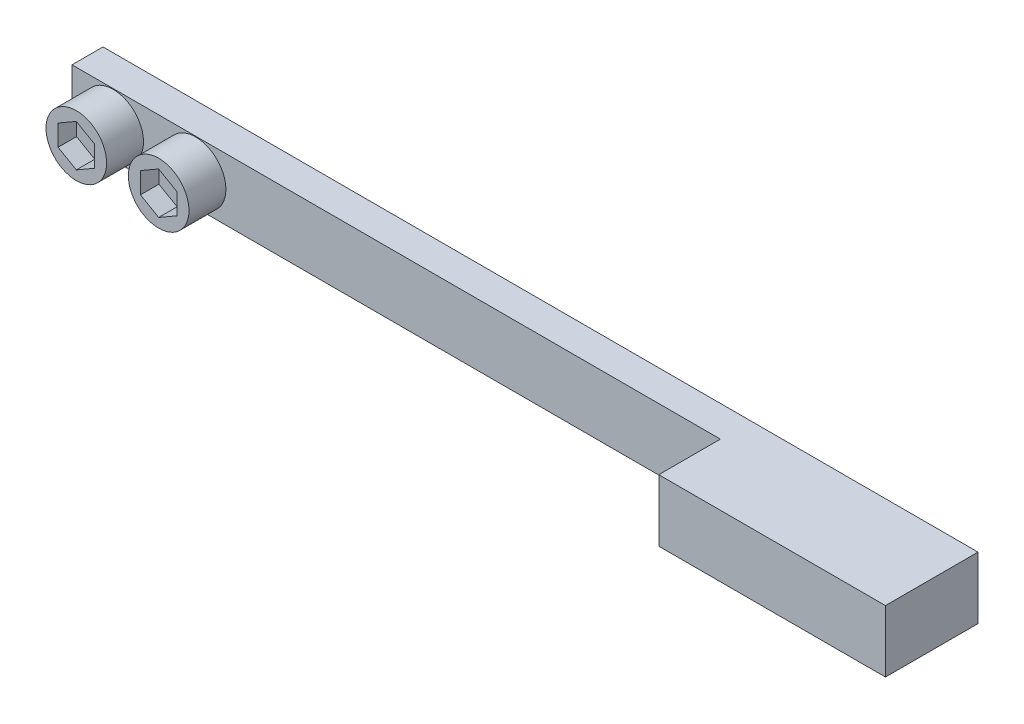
ISO-10303-21;
HEADER;
FILE_DESCRIPTION(('STEP AP214'),'2;1');
FILE_NAME('part.step','',(''),(''),'','','');
FILE_SCHEMA(('AUTOMOTIVE_DESIGN { 1 0 10303 214 1 1 1 1 }'));
ENDSEC;
DATA;
#1=APPLICATION_CONTEXT('core data for automotive mechanical design processes');
#2=APPLICATION_PROTOCOL_DEFINITION('international standard','automotive_design',2000,#1);
#3=PRODUCT_CONTEXT('',#1,'mechanical');
#4=PRODUCT('Part','Part','',(#3));
#5=PRODUCT_RELATED_PRODUCT_CATEGORY('part','',(#4));
#6=PRODUCT_DEFINITION_FORMATION('','',#4);
#7=PRODUCT_DEFINITION_CONTEXT('part definition',#1,'design');
#8=PRODUCT_DEFINITION('design','',#6,#7);
#9=PRODUCT_DEFINITION_SHAPE('','',#8);
#10=(LENGTH_UNIT() NAMED_UNIT(*) SI_UNIT(.MILLI.,.METRE.));
#11=(NAMED_UNIT(*) PLANE_ANGLE_UNIT() SI_UNIT($,.RADIAN.));
#12=(NAMED_UNIT(*) SI_UNIT($,.STERADIAN.) SOLID_ANGLE_UNIT());
#13=UNCERTAINTY_MEASURE_WITH_UNIT(LENGTH_MEASURE(1.E-05),#10,'distance_accuracy_value','');
#14=(GEOMETRIC_REPRESENTATION_CONTEXT(3) GLOBAL_UNCERTAINTY_ASSIGNED_CONTEXT((#13)) GLOBAL_UNIT_ASSIGNED_CONTEXT((#10,
#11,#12)) REPRESENTATION_CONTEXT('',''));
#15=CARTESIAN_POINT('',(0.,0.,0.));
#16=DIRECTION('',(0.,0.,1.));
#17=DIRECTION('',(1.,0.,0.));
#18=AXIS2_PLACEMENT_3D('',#15,#16,#17);
#19=CARTESIAN_POINT('',(-33.7312,2.3876,1.1938));
#20=DIRECTION('',(0.,0.,-1.));
#21=DIRECTION('',(-1.,0.,0.));
#22=AXIS2_PLACEMENT_3D('',#19,#20,#21);
#23=PLANE('',#22);
#24=CARTESIAN_POINT('',(-30.5562,0.,1.1938));
#25=DIRECTION('',(0.,0.,-1.));
#26=DIRECTION('',(-1.,0.,0.));
#27=AXIS2_PLACEMENT_3D('',#24,#25,#26);
#28=CIRCLE('',#27,2.3368);
#29=CARTESIAN_POINT('',(-32.893,0.,1.1938));
#30=VERTEX_POINT('',#29);
#31=EDGE_CURVE('E41',#30,#30,#28,.F.);
#32=ORIENTED_EDGE('',*,*,#31,.F.);
#33=EDGE_LOOP('',(#32));
#34=FACE_BOUND('',#33,.T.);
#35=DIRECTION('',(1.,0.,0.));
#36=VECTOR('',#35,1.);
#37=CARTESIAN_POINT('',(-33.7312,-2.3876,1.1938));
#38=LINE('',#37,#36);
#39=CARTESIAN_POINT('',(-33.7312,-2.3876,1.1938));
#40=VERTEX_POINT('',#39);
#41=CARTESIAN_POINT('',(16.256,-2.3876,1.1938));
#42=VERTEX_POINT('',#41);
#43=EDGE_CURVE('E284',#40,#42,#38,.T.);
#44=ORIENTED_EDGE('',*,*,#43,.T.);
#45=DIRECTION('',(0.,-1.,0.));
#46=VECTOR('',#45,1.);
#47=CARTESIAN_POINT('',(16.256,2.3876,1.1938));
#48=LINE('',#47,#46);
#49=CARTESIAN_POINT('',(16.256,2.3876,1.1938));
#50=VERTEX_POINT('',#49);
#51=EDGE_CURVE('E299',#50,#42,#48,.T.);
#52=ORIENTED_EDGE('',*,*,#51,.F.);
#53=DIRECTION('',(1.,0.,0.));
#54=VECTOR('',#53,1.);
#55=CARTESIAN_POINT('',(-33.7312,2.3876,1.1938));
#56=LINE('',#55,#54);
#57=CARTESIAN_POINT('',(-33.7312,2.3876,1.1938));
#58=VERTEX_POINT('',#57);
#59=EDGE_CURVE('E271',#58,#50,#56,.T.);
#60=ORIENTED_EDGE('',*,*,#59,.F.);
#61=DIRECTION('',(0.,-1.,0.));
#62=VECTOR('',#61,1.);
#63=CARTESIAN_POINT('',(-33.7312,2.3876,1.1938));
#64=LINE('',#63,#62);
#65=EDGE_CURVE('E302',#58,#40,#64,.T.);
#66=ORIENTED_EDGE('',*,*,#65,.T.);
#67=EDGE_LOOP('',(#44,#52,#60,#66));
#68=FACE_BOUND('',#67,.T.);
#69=CARTESIAN_POINT('',(-24.2062,0.,1.1938));
#70=DIRECTION('',(0.,0.,-1.));
#71=DIRECTION('',(-1.,0.,0.));
#72=AXIS2_PLACEMENT_3D('',#69,#70,#71);
#73=CIRCLE('',#72,2.3368);
#74=CARTESIAN_POINT('',(-26.543,0.,1.1938));
#75=VERTEX_POINT('',#74);
#76=EDGE_CURVE('E11',#75,#75,#73,.F.);
#77=ORIENTED_EDGE('',*,*,#76,.F.);
#78=EDGE_LOOP('',(#77));
#79=FACE_BOUND('',#78,.T.);
#80=ADVANCED_FACE('F33',(#34,#68,#79),#23,.F.);
#81=CARTESIAN_POINT('',(33.7312,2.3876,-1.1938));
#82=DIRECTION('',(0.,0.,1.));
#83=DIRECTION('',(1.,0.,0.));
#84=AXIS2_PLACEMENT_3D('',#81,#82,#83);
#85=PLANE('',#84);
#86=DIRECTION('',(-1.,0.,0.));
#87=VECTOR('',#86,1.);
#88=CARTESIAN_POINT('',(33.7312,-2.3876,-1.1938));
#89=LINE('',#88,#87);
#90=CARTESIAN_POINT('',(33.7312,-2.3876,-1.1938));
#91=VERTEX_POINT('',#90);
#92=CARTESIAN_POINT('',(-33.7312,-2.3876,-1.1938));
#93=VERTEX_POINT('',#92);
#94=EDGE_CURVE('E264',#91,#93,#89,.T.);
#95=ORIENTED_EDGE('',*,*,#94,.T.);
#96=DIRECTION('',(0.,-1.,0.));
#97=VECTOR('',#96,1.);
#98=CARTESIAN_POINT('',(-33.7312,2.3876,-1.1938));
#99=LINE('',#98,#97);
#100=CARTESIAN_POINT('',(-33.7312,2.3876,-1.1938));
#101=VERTEX_POINT('',#100);
#102=EDGE_CURVE('E305',#101,#93,#99,.T.);
#103=ORIENTED_EDGE('',*,*,#102,.F.);
#104=DIRECTION('',(-1.,0.,0.));
#105=VECTOR('',#104,1.);
#106=CARTESIAN_POINT('',(33.7312,2.3876,-1.1938));
#107=LINE('',#106,#105);
#108=CARTESIAN_POINT('',(33.7312,2.3876,-1.1938));
#109=VERTEX_POINT('',#108);
#110=EDGE_CURVE('E265',#109,#101,#107,.T.);
#111=ORIENTED_EDGE('',*,*,#110,.F.);
#112=DIRECTION('',(0.,-1.,0.));
#113=VECTOR('',#112,1.);
#114=CARTESIAN_POINT('',(33.7312,2.3876,-1.1938));
#115=LINE('',#114,#113);
#116=EDGE_CURVE('E279',#109,#91,#115,.T.);
#117=ORIENTED_EDGE('',*,*,#116,.T.);
#118=EDGE_LOOP('',(#95,#103,#111,#117));
#119=FACE_BOUND('',#118,.T.);
#120=ADVANCED_FACE('F35',(#119),#85,.F.);
#121=CARTESIAN_POINT('',(-33.7312,2.3876,-1.1938));
#122=DIRECTION('',(1.,0.,0.));
#123=DIRECTION('',(0.,0.,-1.));
#124=AXIS2_PLACEMENT_3D('',#121,#122,#123);
#125=PLANE('',#124);
#126=DIRECTION('',(0.,0.,1.));
#127=VECTOR('',#126,1.);
#128=CARTESIAN_POINT('',(-33.7312,-2.3876,-1.1938));
#129=LINE('',#128,#127);
#130=EDGE_CURVE('E282',#93,#40,#129,.T.);
#131=ORIENTED_EDGE('',*,*,#130,.T.);
#132=ORIENTED_EDGE('',*,*,#65,.F.);
#133=DIRECTION('',(0.,0.,1.));
#134=VECTOR('',#133,1.);
#135=CARTESIAN_POINT('',(-33.7312,2.3876,-1.1938));
#136=LINE('',#135,#134);
#137=EDGE_CURVE('E268',#101,#58,#136,.T.);
#138=ORIENTED_EDGE('',*,*,#137,.F.);
#139=ORIENTED_EDGE('',*,*,#102,.T.);
#140=EDGE_LOOP('',(#131,#132,#138,#139));
#141=FACE_BOUND('',#140,.T.);
#142=ADVANCED_FACE('F385',(#141),#125,.F.);
#143=CARTESIAN_POINT('',(16.256,2.3876,1.1938));
#144=DIRECTION('',(1.,0.,0.));
#145=DIRECTION('',(0.,0.,-1.));
#146=AXIS2_PLACEMENT_3D('',#143,#144,#145);
#147=PLANE('',#146);
#148=DIRECTION('',(0.,0.,1.));
#149=VECTOR('',#148,1.);
#150=CARTESIAN_POINT('',(16.256,-2.3876,1.1938));
#151=LINE('',#150,#149);
#152=CARTESIAN_POINT('',(16.256,-2.3876,5.9436));
#153=VERTEX_POINT('',#152);
#154=EDGE_CURVE('E286',#42,#153,#151,.T.);
#155=ORIENTED_EDGE('',*,*,#154,.T.);
#156=DIRECTION('',(0.,-1.,0.));
#157=VECTOR('',#156,1.);
#158=CARTESIAN_POINT('',(16.256,2.3876,5.9436));
#159=LINE('',#158,#157);
#160=CARTESIAN_POINT('',(16.256,2.3876,5.9436));
#161=VERTEX_POINT('',#160);
#162=EDGE_CURVE('E296',#161,#153,#159,.T.);
#163=ORIENTED_EDGE('',*,*,#162,.F.);
#164=DIRECTION('',(0.,0.,1.));
#165=VECTOR('',#164,1.);
#166=CARTESIAN_POINT('',(16.256,2.3876,1.1938));
#167=LINE('',#166,#165);
#168=EDGE_CURVE('E273',#50,#161,#167,.T.);
#169=ORIENTED_EDGE('',*,*,#168,.F.);
#170=ORIENTED_EDGE('',*,*,#51,.T.);
#171=EDGE_LOOP('',(#155,#163,#169,#170));
#172=FACE_BOUND('',#171,.T.);
#173=ADVANCED_FACE('F382',(#172),#147,.F.);
#174=CARTESIAN_POINT('',(16.256,2.3876,5.9436));
#175=DIRECTION('',(0.,0.,-1.));
#176=DIRECTION('',(-1.,0.,0.));
#177=AXIS2_PLACEMENT_3D('',#174,#175,#176);
#178=PLANE('',#177);
#179=DIRECTION('',(1.,0.,0.));
#180=VECTOR('',#179,1.);
#181=CARTESIAN_POINT('',(16.256,-2.3876,5.9436));
#182=LINE('',#181,#180);
#183=CARTESIAN_POINT('',(33.7312,-2.3876,5.9436));
#184=VERTEX_POINT('',#183);
#185=EDGE_CURVE('E288',#153,#184,#182,.T.);
#186=ORIENTED_EDGE('',*,*,#185,.T.);
#187=DIRECTION('',(0.,-1.,0.));
#188=VECTOR('',#187,1.);
#189=CARTESIAN_POINT('',(33.7312,2.3876,5.9436));
#190=LINE('',#189,#188);
#191=CARTESIAN_POINT('',(33.7312,2.3876,5.9436));
#192=VERTEX_POINT('',#191);
#193=EDGE_CURVE('E293',#192,#184,#190,.T.);
#194=ORIENTED_EDGE('',*,*,#193,.F.);
#195=DIRECTION('',(1.,0.,0.));
#196=VECTOR('',#195,1.);
#197=CARTESIAN_POINT('',(16.256,2.3876,5.9436));
#198=LINE('',#197,#196);
#199=EDGE_CURVE('E275',#161,#192,#198,.T.);
#200=ORIENTED_EDGE('',*,*,#199,.F.);
#201=ORIENTED_EDGE('',*,*,#162,.T.);
#202=EDGE_LOOP('',(#186,#194,#200,#201));
#203=FACE_BOUND('',#202,.T.);
#204=ADVANCED_FACE('F378',(#203),#178,.F.);
#205=CARTESIAN_POINT('',(33.7312,2.3876,5.9436));
#206=DIRECTION('',(-1.,0.,0.));
#207=DIRECTION('',(0.,0.,1.));
#208=AXIS2_PLACEMENT_3D('',#205,#206,#207);
#209=PLANE('',#208);
#210=DIRECTION('',(0.,0.,-1.));
#211=VECTOR('',#210,1.);
#212=CARTESIAN_POINT('',(33.7312,-2.3876,5.9436));
#213=LINE('',#212,#211);
#214=EDGE_CURVE('E269',#184,#91,#213,.T.);
#215=ORIENTED_EDGE('',*,*,#214,.T.);
#216=ORIENTED_EDGE('',*,*,#116,.F.);
#217=DIRECTION('',(0.,0.,-1.));
#218=VECTOR('',#217,1.);
#219=CARTESIAN_POINT('',(33.7312,2.3876,5.9436));
#220=LINE('',#219,#218);
#221=EDGE_CURVE('E277',#192,#109,#220,.T.);
#222=ORIENTED_EDGE('',*,*,#221,.F.);
#223=ORIENTED_EDGE('',*,*,#193,.T.);
#224=EDGE_LOOP('',(#215,#216,#222,#223));
#225=FACE_BOUND('',#224,.T.);
#226=ADVANCED_FACE('F371',(#225),#209,.F.);
#227=CARTESIAN_POINT('',(-33.7312,2.3876,-1.1938));
#228=DIRECTION('',(0.,1.,0.));
#229=DIRECTION('',(0.,0.,1.));
#230=AXIS2_PLACEMENT_3D('',#227,#228,#229);
#231=PLANE('',#230);
#232=ORIENTED_EDGE('',*,*,#110,.T.);
#233=ORIENTED_EDGE('',*,*,#137,.T.);
#234=ORIENTED_EDGE('',*,*,#59,.T.);
#235=ORIENTED_EDGE('',*,*,#168,.T.);
#236=ORIENTED_EDGE('',*,*,#199,.T.);
#237=ORIENTED_EDGE('',*,*,#221,.T.);
#238=EDGE_LOOP('',(#232,#233,#234,#235,#236,#237));
#239=FACE_BOUND('',#238,.T.);
#240=ADVANCED_FACE('F368',(#239),#231,.T.);
#241=CARTESIAN_POINT('',(-33.7312,-2.3876,-1.1938));
#242=DIRECTION('',(0.,1.,0.));
#243=DIRECTION('',(0.,0.,1.));
#244=AXIS2_PLACEMENT_3D('',#241,#242,#243);
#245=PLANE('',#244);
#246=ORIENTED_EDGE('',*,*,#94,.F.);
#247=ORIENTED_EDGE('',*,*,#214,.F.);
#248=ORIENTED_EDGE('',*,*,#185,.F.);
#249=ORIENTED_EDGE('',*,*,#154,.F.);
#250=ORIENTED_EDGE('',*,*,#43,.F.);
#251=ORIENTED_EDGE('',*,*,#130,.F.);
#252=EDGE_LOOP('',(#246,#247,#248,#249,#250,#251));
#253=FACE_BOUND('',#252,.T.);
#254=ADVANCED_FACE('F366',(#253),#245,.F.);
#255=CARTESIAN_POINT('',(-30.5562,0.,4.0386));
#256=DIRECTION('',(0.,0.,-1.));
#257=DIRECTION('',(-1.,0.,0.));
#258=AXIS2_PLACEMENT_3D('',#255,#256,#257);
#259=CYLINDRICAL_SURFACE('',#258,2.3368);
#260=CARTESIAN_POINT('',(-30.5562,0.,4.0386));
#261=DIRECTION('',(0.,0.,1.));
#262=DIRECTION('',(1.,0.,0.));
#263=AXIS2_PLACEMENT_3D('',#260,#261,#262);
#264=CIRCLE('',#263,2.3368);
#265=CARTESIAN_POINT('',(-28.2194,0.,4.0386));
#266=VERTEX_POINT('',#265);
#267=EDGE_CURVE('E252',#266,#266,#264,.T.);
#268=ORIENTED_EDGE('',*,*,#267,.F.);
#269=EDGE_LOOP('',(#268));
#270=FACE_BOUND('',#269,.T.);
#271=ORIENTED_EDGE('',*,*,#31,.T.);
#272=EDGE_LOOP('',(#271));
#273=FACE_BOUND('',#272,.T.);
#274=ADVANCED_FACE('F310',(#270,#273),#259,.T.);
#275=CARTESIAN_POINT('',(-30.5562,0.,4.0386));
#276=DIRECTION('',(0.,0.,1.));
#277=DIRECTION('',(1.,0.,0.));
#278=AXIS2_PLACEMENT_3D('',#275,#276,#277);
#279=PLANE('',#278);
#280=DIRECTION('',(-0.866025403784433,-0.500000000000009,0.));
#281=VECTOR('',#280,1.);
#282=CARTESIAN_POINT('',(-30.5562,1.6189825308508,4.0386));
#283=LINE('',#282,#281);
#284=CARTESIAN_POINT('',(-30.5562,1.6189825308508,4.0386));
#285=VERTEX_POINT('',#284);
#286=CARTESIAN_POINT('',(-31.95828,0.80949126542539,4.0386));
#287=VERTEX_POINT('',#286);
#288=EDGE_CURVE('E56',#285,#287,#283,.T.);
#289=ORIENTED_EDGE('',*,*,#288,.F.);
#290=DIRECTION('',(-0.866025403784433,0.500000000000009,0.));
#291=VECTOR('',#290,1.);
#292=CARTESIAN_POINT('',(-29.15412,0.80949126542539,4.0386));
#293=LINE('',#292,#291);
#294=CARTESIAN_POINT('',(-29.15412,0.80949126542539,4.0386));
#295=VERTEX_POINT('',#294);
#296=EDGE_CURVE('E219',#295,#285,#293,.T.);
#297=ORIENTED_EDGE('',*,*,#296,.F.);
#298=DIRECTION('',(0.,1.,0.));
#299=VECTOR('',#298,1.);
#300=CARTESIAN_POINT('',(-29.15412,-0.80949126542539,4.0386));
#301=LINE('',#300,#299);
#302=CARTESIAN_POINT('',(-29.15412,-0.80949126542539,4.0386));
#303=VERTEX_POINT('',#302);
#304=EDGE_CURVE('E245',#303,#295,#301,.T.);
#305=ORIENTED_EDGE('',*,*,#304,.F.);
#306=DIRECTION('',(0.866025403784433,0.500000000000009,0.));
#307=VECTOR('',#306,1.);
#308=CARTESIAN_POINT('',(-30.5562,-1.6189825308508,4.0386));
#309=LINE('',#308,#307);
#310=CARTESIAN_POINT('',(-30.5562,-1.6189825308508,4.0386));
#311=VERTEX_POINT('',#310);
#312=EDGE_CURVE('E242',#311,#303,#309,.T.);
#313=ORIENTED_EDGE('',*,*,#312,.F.);
#314=DIRECTION('',(0.866025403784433,-0.500000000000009,0.));
#315=VECTOR('',#314,1.);
#316=CARTESIAN_POINT('',(-31.95828,-0.80949126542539,4.0386));
#317=LINE('',#316,#315);
#318=CARTESIAN_POINT('',(-31.95828,-0.80949126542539,4.0386));
#319=VERTEX_POINT('',#318);
#320=EDGE_CURVE('E239',#319,#311,#317,.T.);
#321=ORIENTED_EDGE('',*,*,#320,.F.);
#322=DIRECTION('',(0.,-1.,0.));
#323=VECTOR('',#322,1.);
#324=CARTESIAN_POINT('',(-31.95828,0.80949126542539,4.0386));
#325=LINE('',#324,#323);
#326=EDGE_CURVE('E236',#287,#319,#325,.T.);
#327=ORIENTED_EDGE('',*,*,#326,.F.);
#328=EDGE_LOOP('',(#289,#297,#305,#313,#321,#327));
#329=FACE_BOUND('',#328,.T.);
#330=ORIENTED_EDGE('',*,*,#267,.T.);
#331=EDGE_LOOP('',(#330));
#332=FACE_BOUND('',#331,.T.);
#333=ADVANCED_FACE('F360',(#329,#332),#279,.T.);
#334=CARTESIAN_POINT('',(-30.5562,1.6189825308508,2.6162));
#335=DIRECTION('',(-0.500000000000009,0.866025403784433,0.));
#336=DIRECTION('',(-0.866025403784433,-0.500000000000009,0.));
#337=AXIS2_PLACEMENT_3D('',#334,#335,#336);
#338=PLANE('',#337);
#339=ORIENTED_EDGE('',*,*,#288,.T.);
#340=DIRECTION('',(0.,0.,1.));
#341=VECTOR('',#340,1.);
#342=CARTESIAN_POINT('',(-31.95828,0.80949126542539,2.6162));
#343=LINE('',#342,#341);
#344=CARTESIAN_POINT('',(-31.95828,0.80949126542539,2.6162));
#345=VERTEX_POINT('',#344);
#346=EDGE_CURVE('E234',#345,#287,#343,.T.);
#347=ORIENTED_EDGE('',*,*,#346,.F.);
#348=DIRECTION('',(-0.866025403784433,-0.500000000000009,0.));
#349=VECTOR('',#348,1.);
#350=CARTESIAN_POINT('',(-30.5562,1.6189825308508,2.6162));
#351=LINE('',#350,#349);
#352=CARTESIAN_POINT('',(-30.5562,1.6189825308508,2.6162));
#353=VERTEX_POINT('',#352);
#354=EDGE_CURVE('E215',#353,#345,#351,.T.);
#355=ORIENTED_EDGE('',*,*,#354,.F.);
#356=DIRECTION('',(0.,0.,1.));
#357=VECTOR('',#356,1.);
#358=CARTESIAN_POINT('',(-30.5562,1.6189825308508,2.6162));
#359=LINE('',#358,#357);
#360=EDGE_CURVE('E250',#353,#285,#359,.T.);
#361=ORIENTED_EDGE('',*,*,#360,.T.);
#362=EDGE_LOOP('',(#339,#347,#355,#361));
#363=FACE_BOUND('',#362,.T.);
#364=ADVANCED_FACE('F342',(#363),#338,.F.);
#365=CARTESIAN_POINT('',(-29.15412,0.80949126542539,2.6162));
#366=DIRECTION('',(0.500000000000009,0.866025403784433,0.));
#367=DIRECTION('',(-0.866025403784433,0.500000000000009,0.));
#368=AXIS2_PLACEMENT_3D('',#365,#366,#367);
#369=PLANE('',#368);
#370=ORIENTED_EDGE('',*,*,#296,.T.);
#371=ORIENTED_EDGE('',*,*,#360,.F.);
#372=DIRECTION('',(-0.866025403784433,0.500000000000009,0.));
#373=VECTOR('',#372,1.);
#374=CARTESIAN_POINT('',(-29.15412,0.80949126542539,2.6162));
#375=LINE('',#374,#373);
#376=CARTESIAN_POINT('',(-29.15412,0.80949126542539,2.6162));
#377=VERTEX_POINT('',#376);
#378=EDGE_CURVE('E231',#377,#353,#375,.T.);
#379=ORIENTED_EDGE('',*,*,#378,.F.);
#380=DIRECTION('',(0.,0.,1.));
#381=VECTOR('',#380,1.);
#382=CARTESIAN_POINT('',(-29.15412,0.80949126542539,2.6162));
#383=LINE('',#382,#381);
#384=EDGE_CURVE('E253',#377,#295,#383,.T.);
#385=ORIENTED_EDGE('',*,*,#384,.T.);
#386=EDGE_LOOP('',(#370,#371,#379,#385));
#387=FACE_BOUND('',#386,.T.);
#388=ADVANCED_FACE('F338',(#387),#369,.F.);
#389=CARTESIAN_POINT('',(-29.15412,-0.80949126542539,2.6162));
#390=DIRECTION('',(1.,0.,0.));
#391=DIRECTION('',(0.,0.,-1.));
#392=AXIS2_PLACEMENT_3D('',#389,#390,#391);
#393=PLANE('',#392);
#394=ORIENTED_EDGE('',*,*,#304,.T.);
#395=ORIENTED_EDGE('',*,*,#384,.F.);
#396=DIRECTION('',(0.,1.,0.));
#397=VECTOR('',#396,1.);
#398=CARTESIAN_POINT('',(-29.15412,-0.80949126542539,2.6162));
#399=LINE('',#398,#397);
#400=CARTESIAN_POINT('',(-29.15412,-0.80949126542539,2.6162));
#401=VERTEX_POINT('',#400);
#402=EDGE_CURVE('E228',#401,#377,#399,.T.);
#403=ORIENTED_EDGE('',*,*,#402,.F.);
#404=DIRECTION('',(0.,0.,1.));
#405=VECTOR('',#404,1.);
#406=CARTESIAN_POINT('',(-29.15412,-0.80949126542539,2.6162));
#407=LINE('',#406,#405);
#408=EDGE_CURVE('E255',#401,#303,#407,.T.);
#409=ORIENTED_EDGE('',*,*,#408,.T.);
#410=EDGE_LOOP('',(#394,#395,#403,#409));
#411=FACE_BOUND('',#410,.T.);
#412=ADVANCED_FACE('F341',(#411),#393,.F.);
#413=CARTESIAN_POINT('',(-30.5562,-1.6189825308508,2.6162));
#414=DIRECTION('',(0.500000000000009,-0.866025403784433,0.));
#415=DIRECTION('',(0.866025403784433,0.500000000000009,0.));
#416=AXIS2_PLACEMENT_3D('',#413,#414,#415);
#417=PLANE('',#416);
#418=ORIENTED_EDGE('',*,*,#312,.T.);
#419=ORIENTED_EDGE('',*,*,#408,.F.);
#420=DIRECTION('',(0.866025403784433,0.500000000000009,0.));
#421=VECTOR('',#420,1.);
#422=CARTESIAN_POINT('',(-30.5562,-1.6189825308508,2.6162));
#423=LINE('',#422,#421);
#424=CARTESIAN_POINT('',(-30.5562,-1.6189825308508,2.6162));
#425=VERTEX_POINT('',#424);
#426=EDGE_CURVE('E225',#425,#401,#423,.T.);
#427=ORIENTED_EDGE('',*,*,#426,.F.);
#428=DIRECTION('',(0.,0.,1.));
#429=VECTOR('',#428,1.);
#430=CARTESIAN_POINT('',(-30.5562,-1.6189825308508,2.6162));
#431=LINE('',#430,#429);
#432=EDGE_CURVE('E257',#425,#311,#431,.T.);
#433=ORIENTED_EDGE('',*,*,#432,.T.);
#434=EDGE_LOOP('',(#418,#419,#427,#433));
#435=FACE_BOUND('',#434,.T.);
#436=ADVANCED_FACE('F346',(#435),#417,.F.);
#437=CARTESIAN_POINT('',(-31.95828,-0.80949126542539,2.6162));
#438=DIRECTION('',(-0.500000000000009,-0.866025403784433,0.));
#439=DIRECTION('',(0.866025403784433,-0.500000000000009,0.));
#440=AXIS2_PLACEMENT_3D('',#437,#438,#439);
#441=PLANE('',#440);
#442=ORIENTED_EDGE('',*,*,#320,.T.);
#443=ORIENTED_EDGE('',*,*,#432,.F.);
#444=DIRECTION('',(0.866025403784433,-0.500000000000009,0.));
#445=VECTOR('',#444,1.);
#446=CARTESIAN_POINT('',(-31.95828,-0.80949126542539,2.6162));
#447=LINE('',#446,#445);
#448=CARTESIAN_POINT('',(-31.95828,-0.80949126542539,2.6162));
#449=VERTEX_POINT('',#448);
#450=EDGE_CURVE('E222',#449,#425,#447,.T.);
#451=ORIENTED_EDGE('',*,*,#450,.F.);
#452=DIRECTION('',(0.,0.,1.));
#453=VECTOR('',#452,1.);
#454=CARTESIAN_POINT('',(-31.95828,-0.80949126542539,2.6162));
#455=LINE('',#454,#453);
#456=EDGE_CURVE('E259',#449,#319,#455,.T.);
#457=ORIENTED_EDGE('',*,*,#456,.T.);
#458=EDGE_LOOP('',(#442,#443,#451,#457));
#459=FACE_BOUND('',#458,.T.);
#460=ADVANCED_FACE('F350',(#459),#441,.F.);
#461=CARTESIAN_POINT('',(-31.95828,0.80949126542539,2.6162));
#462=DIRECTION('',(-1.,0.,0.));
#463=DIRECTION('',(0.,0.,1.));
#464=AXIS2_PLACEMENT_3D('',#461,#462,#463);
#465=PLANE('',#464);
#466=ORIENTED_EDGE('',*,*,#326,.T.);
#467=ORIENTED_EDGE('',*,*,#456,.F.);
#468=DIRECTION('',(0.,-1.,0.));
#469=VECTOR('',#468,1.);
#470=CARTESIAN_POINT('',(-31.95828,0.80949126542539,2.6162));
#471=LINE('',#470,#469);
#472=EDGE_CURVE('E218',#345,#449,#471,.T.);
#473=ORIENTED_EDGE('',*,*,#472,.F.);
#474=ORIENTED_EDGE('',*,*,#346,.T.);
#475=EDGE_LOOP('',(#466,#467,#473,#474));
#476=FACE_BOUND('',#475,.T.);
#477=ADVANCED_FACE('F332',(#476),#465,.F.);
#478=CARTESIAN_POINT('',(-33.36036,0.,2.6162));
#479=DIRECTION('',(0.,0.,1.));
#480=DIRECTION('',(1.,0.,0.));
#481=AXIS2_PLACEMENT_3D('',#478,#479,#480);
#482=PLANE('',#481);
#483=ORIENTED_EDGE('',*,*,#354,.T.);
#484=ORIENTED_EDGE('',*,*,#472,.T.);
#485=ORIENTED_EDGE('',*,*,#450,.T.);
#486=ORIENTED_EDGE('',*,*,#426,.T.);
#487=ORIENTED_EDGE('',*,*,#402,.T.);
#488=ORIENTED_EDGE('',*,*,#378,.T.);
#489=EDGE_LOOP('',(#483,#484,#485,#486,#487,#488));
#490=FACE_BOUND('',#489,.T.);
#491=ADVANCED_FACE('F323',(#490),#482,.T.);
#492=CARTESIAN_POINT('',(-24.2062,0.,4.0386));
#493=DIRECTION('',(0.,0.,-1.));
#494=DIRECTION('',(-1.,0.,0.));
#495=AXIS2_PLACEMENT_3D('',#492,#493,#494);
#496=CYLINDRICAL_SURFACE('',#495,2.3368);
#497=CARTESIAN_POINT('',(-24.2062,0.,4.0386));
#498=DIRECTION('',(0.,0.,1.));
#499=DIRECTION('',(1.,0.,0.));
#500=AXIS2_PLACEMENT_3D('',#497,#498,#499);
#501=CIRCLE('',#500,2.3368);
#502=CARTESIAN_POINT('',(-21.8694,0.,4.0386));
#503=VERTEX_POINT('',#502);
#504=EDGE_CURVE('E205',#503,#503,#501,.T.);
#505=ORIENTED_EDGE('',*,*,#504,.F.);
#506=EDGE_LOOP('',(#505));
#507=FACE_BOUND('',#506,.T.);
#508=ORIENTED_EDGE('',*,*,#76,.T.);
#509=EDGE_LOOP('',(#508));
#510=FACE_BOUND('',#509,.T.);
#511=ADVANCED_FACE('F320',(#507,#510),#496,.T.);
#512=CARTESIAN_POINT('',(-24.2062,0.,4.0386));
#513=DIRECTION('',(0.,0.,1.));
#514=DIRECTION('',(1.,0.,0.));
#515=AXIS2_PLACEMENT_3D('',#512,#513,#514);
#516=PLANE('',#515);
#517=DIRECTION('',(-0.866025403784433,-0.500000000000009,0.));
#518=VECTOR('',#517,1.);
#519=CARTESIAN_POINT('',(-24.2062,1.6189825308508,4.0386));
#520=LINE('',#519,#518);
#521=CARTESIAN_POINT('',(-24.2062,1.6189825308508,4.0386));
#522=VERTEX_POINT('',#521);
#523=CARTESIAN_POINT('',(-25.60828,0.80949126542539,4.0386));
#524=VERTEX_POINT('',#523);
#525=EDGE_CURVE('E48',#522,#524,#520,.T.);
#526=ORIENTED_EDGE('',*,*,#525,.F.);
#527=DIRECTION('',(-0.866025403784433,0.500000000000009,0.));
#528=VECTOR('',#527,1.);
#529=CARTESIAN_POINT('',(-22.80412,0.80949126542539,4.0386));
#530=LINE('',#529,#528);
#531=CARTESIAN_POINT('',(-22.80412,0.80949126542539,4.0386));
#532=VERTEX_POINT('',#531);
#533=EDGE_CURVE('E179',#532,#522,#530,.T.);
#534=ORIENTED_EDGE('',*,*,#533,.F.);
#535=DIRECTION('',(0.,1.,0.));
#536=VECTOR('',#535,1.);
#537=CARTESIAN_POINT('',(-22.80412,-0.80949126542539,4.0386));
#538=LINE('',#537,#536);
#539=CARTESIAN_POINT('',(-22.80412,-0.80949126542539,4.0386));
#540=VERTEX_POINT('',#539);
#541=EDGE_CURVE('E182',#540,#532,#538,.T.);
#542=ORIENTED_EDGE('',*,*,#541,.F.);
#543=DIRECTION('',(0.866025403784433,0.500000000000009,0.));
#544=VECTOR('',#543,1.);
#545=CARTESIAN_POINT('',(-24.2062,-1.6189825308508,4.0386));
#546=LINE('',#545,#544);
#547=CARTESIAN_POINT('',(-24.2062,-1.6189825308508,4.0386));
#548=VERTEX_POINT('',#547);
#549=EDGE_CURVE('E198',#548,#540,#546,.T.);
#550=ORIENTED_EDGE('',*,*,#549,.F.);
#551=DIRECTION('',(0.866025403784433,-0.500000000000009,0.));
#552=VECTOR('',#551,1.);
#553=CARTESIAN_POINT('',(-25.60828,-0.80949126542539,4.0386));
#554=LINE('',#553,#552);
#555=CARTESIAN_POINT('',(-25.60828,-0.80949126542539,4.0386));
#556=VERTEX_POINT('',#555);
#557=EDGE_CURVE('E195',#556,#548,#554,.T.);
#558=ORIENTED_EDGE('',*,*,#557,.F.);
#559=DIRECTION('',(0.,-1.,0.));
#560=VECTOR('',#559,1.);
#561=CARTESIAN_POINT('',(-25.60828,0.80949126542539,4.0386));
#562=LINE('',#561,#560);
#563=EDGE_CURVE('E193',#524,#556,#562,.T.);
#564=ORIENTED_EDGE('',*,*,#563,.F.);
#565=EDGE_LOOP('',(#526,#534,#542,#550,#558,#564));
#566=FACE_BOUND('',#565,.T.);
#567=ORIENTED_EDGE('',*,*,#504,.T.);
#568=EDGE_LOOP('',(#567));
#569=FACE_BOUND('',#568,.T.);
#570=ADVANCED_FACE('F322',(#566,#569),#516,.T.);
#571=CARTESIAN_POINT('',(-24.2062,1.6189825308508,2.6162));
#572=DIRECTION('',(-0.500000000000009,0.866025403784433,0.));
#573=DIRECTION('',(-0.866025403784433,-0.500000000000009,0.));
#574=AXIS2_PLACEMENT_3D('',#571,#572,#573);
#575=PLANE('',#574);
#576=ORIENTED_EDGE('',*,*,#525,.T.);
#577=DIRECTION('',(0.,0.,1.));
#578=VECTOR('',#577,1.);
#579=CARTESIAN_POINT('',(-25.60828,0.80949126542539,2.6162));
#580=LINE('',#579,#578);
#581=CARTESIAN_POINT('',(-25.60828,0.80949126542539,2.6162));
#582=VERTEX_POINT('',#581);
#583=EDGE_CURVE('E156',#582,#524,#580,.T.);
#584=ORIENTED_EDGE('',*,*,#583,.F.);
#585=DIRECTION('',(-0.866025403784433,-0.500000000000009,0.));
#586=VECTOR('',#585,1.);
#587=CARTESIAN_POINT('',(-24.2062,1.6189825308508,2.6162));
#588=LINE('',#587,#586);
#589=CARTESIAN_POINT('',(-24.2062,1.6189825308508,2.6162));
#590=VERTEX_POINT('',#589);
#591=EDGE_CURVE('E160',#590,#582,#588,.T.);
#592=ORIENTED_EDGE('',*,*,#591,.F.);
#593=DIRECTION('',(0.,0.,1.));
#594=VECTOR('',#593,1.);
#595=CARTESIAN_POINT('',(-24.2062,1.6189825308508,2.6162));
#596=LINE('',#595,#594);
#597=EDGE_CURVE('E203',#590,#522,#596,.T.);
#598=ORIENTED_EDGE('',*,*,#597,.T.);
#599=EDGE_LOOP('',(#576,#584,#592,#598));
#600=FACE_BOUND('',#599,.T.);
#601=ADVANCED_FACE('F158',(#600),#575,.F.);
#602=CARTESIAN_POINT('',(-22.80412,0.80949126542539,2.6162));
#603=DIRECTION('',(0.500000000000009,0.866025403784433,0.));
#604=DIRECTION('',(-0.866025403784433,0.500000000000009,0.));
#605=AXIS2_PLACEMENT_3D('',#602,#603,#604);
#606=PLANE('',#605);
#607=ORIENTED_EDGE('',*,*,#533,.T.);
#608=ORIENTED_EDGE('',*,*,#597,.F.);
#609=DIRECTION('',(-0.866025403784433,0.500000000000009,0.));
#610=VECTOR('',#609,1.);
#611=CARTESIAN_POINT('',(-22.80412,0.80949126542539,2.6162));
#612=LINE('',#611,#610);
#613=CARTESIAN_POINT('',(-22.80412,0.80949126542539,2.6162));
#614=VERTEX_POINT('',#613);
#615=EDGE_CURVE('E166',#614,#590,#612,.T.);
#616=ORIENTED_EDGE('',*,*,#615,.F.);
#617=DIRECTION('',(0.,0.,1.));
#618=VECTOR('',#617,1.);
#619=CARTESIAN_POINT('',(-22.80412,0.80949126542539,2.6162));
#620=LINE('',#619,#618);
#621=EDGE_CURVE('E206',#614,#532,#620,.T.);
#622=ORIENTED_EDGE('',*,*,#621,.T.);
#623=EDGE_LOOP('',(#607,#608,#616,#622));
#624=FACE_BOUND('',#623,.T.);
#625=ADVANCED_FACE('F436',(#624),#606,.F.);
#626=CARTESIAN_POINT('',(-22.80412,-0.80949126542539,2.6162));
#627=DIRECTION('',(1.,0.,0.));
#628=DIRECTION('',(0.,0.,-1.));
#629=AXIS2_PLACEMENT_3D('',#626,#627,#628);
#630=PLANE('',#629);
#631=ORIENTED_EDGE('',*,*,#541,.T.);
#632=ORIENTED_EDGE('',*,*,#621,.F.);
#633=DIRECTION('',(0.,1.,0.));
#634=VECTOR('',#633,1.);
#635=CARTESIAN_POINT('',(-22.80412,-0.80949126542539,2.6162));
#636=LINE('',#635,#634);
#637=CARTESIAN_POINT('',(-22.80412,-0.80949126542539,2.6162));
#638=VERTEX_POINT('',#637);
#639=EDGE_CURVE('E189',#638,#614,#636,.T.);
#640=ORIENTED_EDGE('',*,*,#639,.F.);
#641=DIRECTION('',(0.,0.,1.));
#642=VECTOR('',#641,1.);
#643=CARTESIAN_POINT('',(-22.80412,-0.80949126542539,2.6162));
#644=LINE('',#643,#642);
#645=EDGE_CURVE('E208',#638,#540,#644,.T.);
#646=ORIENTED_EDGE('',*,*,#645,.T.);
#647=EDGE_LOOP('',(#631,#632,#640,#646));
#648=FACE_BOUND('',#647,.T.);
#649=ADVANCED_FACE('F444',(#648),#630,.F.);
#650=CARTESIAN_POINT('',(-24.2062,-1.6189825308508,2.6162));
#651=DIRECTION('',(0.500000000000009,-0.866025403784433,0.));
#652=DIRECTION('',(0.866025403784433,0.500000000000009,0.));
#653=AXIS2_PLACEMENT_3D('',#650,#651,#652);
#654=PLANE('',#653);
#655=ORIENTED_EDGE('',*,*,#549,.T.);
#656=ORIENTED_EDGE('',*,*,#645,.F.);
#657=DIRECTION('',(0.866025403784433,0.500000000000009,0.));
#658=VECTOR('',#657,1.);
#659=CARTESIAN_POINT('',(-24.2062,-1.6189825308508,2.6162));
#660=LINE('',#659,#658);
#661=CARTESIAN_POINT('',(-24.2062,-1.6189825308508,2.6162));
#662=VERTEX_POINT('',#661);
#663=EDGE_CURVE('E186',#662,#638,#660,.T.);
#664=ORIENTED_EDGE('',*,*,#663,.F.);
#665=DIRECTION('',(0.,0.,1.));
#666=VECTOR('',#665,1.);
#667=CARTESIAN_POINT('',(-24.2062,-1.6189825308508,2.6162));
#668=LINE('',#667,#666);
#669=EDGE_CURVE('E210',#662,#548,#668,.T.);
#670=ORIENTED_EDGE('',*,*,#669,.T.);
#671=EDGE_LOOP('',(#655,#656,#664,#670));
#672=FACE_BOUND('',#671,.T.);
#673=ADVANCED_FACE('F454',(#672),#654,.F.);
#674=CARTESIAN_POINT('',(-25.60828,-0.80949126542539,2.6162));
#675=DIRECTION('',(-0.500000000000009,-0.866025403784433,0.));
#676=DIRECTION('',(0.866025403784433,-0.500000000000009,0.));
#677=AXIS2_PLACEMENT_3D('',#674,#675,#676);
#678=PLANE('',#677);
#679=ORIENTED_EDGE('',*,*,#557,.T.);
#680=ORIENTED_EDGE('',*,*,#669,.F.);
#681=DIRECTION('',(0.866025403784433,-0.500000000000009,0.));
#682=VECTOR('',#681,1.);
#683=CARTESIAN_POINT('',(-25.60828,-0.80949126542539,2.6162));
#684=LINE('',#683,#682);
#685=CARTESIAN_POINT('',(-25.60828,-0.80949126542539,2.6162));
#686=VERTEX_POINT('',#685);
#687=EDGE_CURVE('E174',#686,#662,#684,.T.);
#688=ORIENTED_EDGE('',*,*,#687,.F.);
#689=DIRECTION('',(0.,0.,1.));
#690=VECTOR('',#689,1.);
#691=CARTESIAN_POINT('',(-25.60828,-0.80949126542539,2.6162));
#692=LINE('',#691,#690);
#693=EDGE_CURVE('E165',#686,#556,#692,.T.);
#694=ORIENTED_EDGE('',*,*,#693,.T.);
#695=EDGE_LOOP('',(#679,#680,#688,#694));
#696=FACE_BOUND('',#695,.T.);
#697=ADVANCED_FACE('F464',(#696),#678,.F.);
#698=CARTESIAN_POINT('',(-25.60828,0.80949126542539,2.6162));
#699=DIRECTION('',(-1.,0.,0.));
#700=DIRECTION('',(0.,0.,1.));
#701=AXIS2_PLACEMENT_3D('',#698,#699,#700);
#702=PLANE('',#701);
#703=ORIENTED_EDGE('',*,*,#563,.T.);
#704=ORIENTED_EDGE('',*,*,#693,.F.);
#705=DIRECTION('',(0.,-1.,0.));
#706=VECTOR('',#705,1.);
#707=CARTESIAN_POINT('',(-25.60828,0.80949126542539,2.6162));
#708=LINE('',#707,#706);
#709=EDGE_CURVE('E169',#582,#686,#708,.T.);
#710=ORIENTED_EDGE('',*,*,#709,.F.);
#711=ORIENTED_EDGE('',*,*,#583,.T.);
#712=EDGE_LOOP('',(#703,#704,#710,#711));
#713=FACE_BOUND('',#712,.T.);
#714=ADVANCED_FACE('F170',(#713),#702,.F.);
#715=CARTESIAN_POINT('',(-27.01036,0.,2.6162));
#716=DIRECTION('',(0.,0.,1.));
#717=DIRECTION('',(1.,0.,0.));
#718=AXIS2_PLACEMENT_3D('',#715,#716,#717);
#719=PLANE('',#718);
#720=ORIENTED_EDGE('',*,*,#591,.T.);
#721=ORIENTED_EDGE('',*,*,#709,.T.);
#722=ORIENTED_EDGE('',*,*,#687,.T.);
#723=ORIENTED_EDGE('',*,*,#663,.T.);
#724=ORIENTED_EDGE('',*,*,#639,.T.);
#725=ORIENTED_EDGE('',*,*,#615,.T.);
#726=EDGE_LOOP('',(#720,#721,#722,#723,#724,#725));
#727=FACE_BOUND('',#726,.T.);
#728=ADVANCED_FACE('F176',(#727),#719,.T.);
#729=CLOSED_SHELL('',(#80,#120,#142,#173,#204,#226,#240,#254,#274,#333,#364,#388,#412,#436,#460,
#477,#491,#511,#570,#601,#625,#649,#673,#697,#714,#728));
#730=MANIFOLD_SOLID_BREP('B2',#729);
#731=ADVANCED_BREP_SHAPE_REPRESENTATION('',(#18,#730),#14);
#732=SHAPE_DEFINITION_REPRESENTATION(#9,#731);
ENDSEC;
END-ISO-10303-21;
